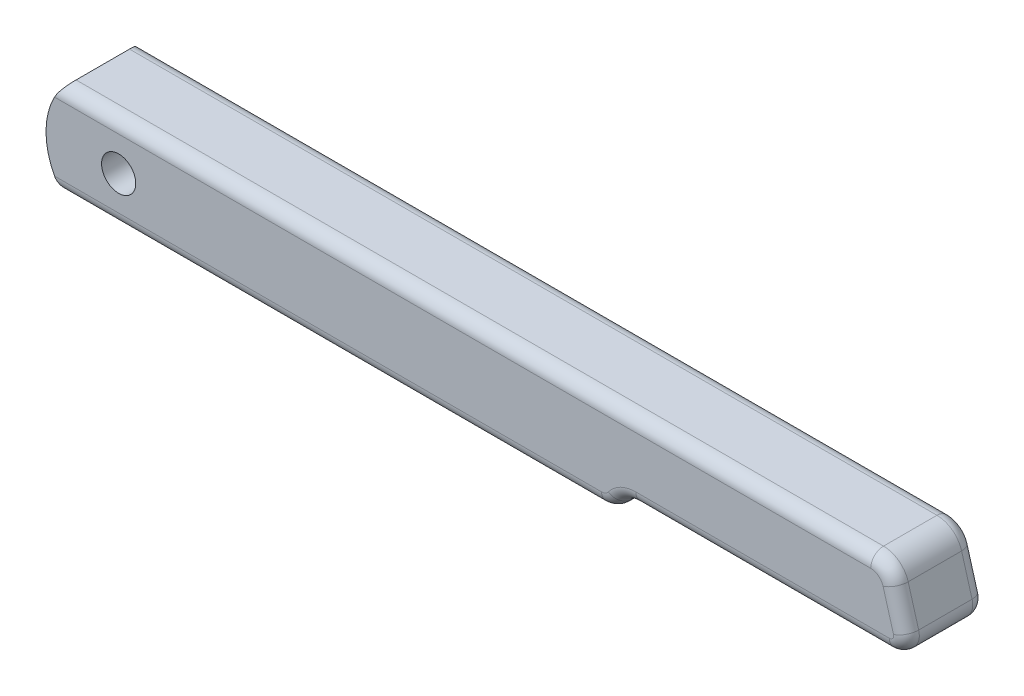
ISO-10303-21;
HEADER;
FILE_DESCRIPTION(('STEP AP214'),'2;1');
FILE_NAME('part.step','',(''),(''),'','','');
FILE_SCHEMA(('AUTOMOTIVE_DESIGN { 1 0 10303 214 1 1 1 1 }'));
ENDSEC;
DATA;
#1=APPLICATION_CONTEXT('core data for automotive mechanical design processes');
#2=APPLICATION_PROTOCOL_DEFINITION('international standard','automotive_design',2000,#1);
#3=PRODUCT_CONTEXT('',#1,'mechanical');
#4=PRODUCT('Part','Part','',(#3));
#5=PRODUCT_RELATED_PRODUCT_CATEGORY('part','',(#4));
#6=PRODUCT_DEFINITION_FORMATION('','',#4);
#7=PRODUCT_DEFINITION_CONTEXT('part definition',#1,'design');
#8=PRODUCT_DEFINITION('design','',#6,#7);
#9=PRODUCT_DEFINITION_SHAPE('','',#8);
#10=(LENGTH_UNIT() NAMED_UNIT(*) SI_UNIT(.MILLI.,.METRE.));
#11=(NAMED_UNIT(*) PLANE_ANGLE_UNIT() SI_UNIT($,.RADIAN.));
#12=(NAMED_UNIT(*) SI_UNIT($,.STERADIAN.) SOLID_ANGLE_UNIT());
#13=UNCERTAINTY_MEASURE_WITH_UNIT(LENGTH_MEASURE(1.E-05),#10,'distance_accuracy_value','');
#14=(GEOMETRIC_REPRESENTATION_CONTEXT(3) GLOBAL_UNCERTAINTY_ASSIGNED_CONTEXT((#13)) GLOBAL_UNIT_ASSIGNED_CONTEXT((#10,
#11,#12)) REPRESENTATION_CONTEXT('',''));
#15=CARTESIAN_POINT('',(0.,0.,0.));
#16=DIRECTION('',(0.,0.,1.));
#17=DIRECTION('',(1.,0.,0.));
#18=AXIS2_PLACEMENT_3D('',#15,#16,#17);
#19=CARTESIAN_POINT('',(0.,0.,18.5));
#20=DIRECTION('',(0.,0.,1.));
#21=DIRECTION('',(1.,0.,0.));
#22=AXIS2_PLACEMENT_3D('',#19,#20,#21);
#23=PLANE('',#22);
#24=CARTESIAN_POINT('',(175.978675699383,5.,18.5));
#25=DIRECTION('',(0.,0.,1.));
#26=DIRECTION('',(1.,0.,0.));
#27=AXIS2_PLACEMENT_3D('',#24,#25,#26);
#28=CIRCLE('',#27,3.);
#29=CARTESIAN_POINT('',(178.862460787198,5.82691206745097,18.5));
#30=VERTEX_POINT('',#29);
#31=CARTESIAN_POINT('',(175.978675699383,8.,18.5));
#32=VERTEX_POINT('',#31);
#33=EDGE_CURVE('E608',#30,#32,#28,.T.);
#34=ORIENTED_EDGE('',*,*,#33,.T.);
#35=DIRECTION('',(-1.,0.,0.));
#36=VECTOR('',#35,1.);
#37=CARTESIAN_POINT('',(-12.9614813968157,8.,18.5));
#38=LINE('',#37,#36);
#39=CARTESIAN_POINT('',(-15.,8.,18.5));
#40=VERTEX_POINT('',#39);
#41=EDGE_CURVE('E610',#32,#40,#38,.T.);
#42=ORIENTED_EDGE('',*,*,#41,.T.);
#43=CARTESIAN_POINT('',(0.,0.,18.5));
#44=DIRECTION('',(0.,0.,1.));
#45=DIRECTION('',(1.,0.,0.));
#46=AXIS2_PLACEMENT_3D('',#43,#44,#45);
#47=CIRCLE('',#46,17.);
#48=CARTESIAN_POINT('',(-15.,-8.,18.5));
#49=VERTEX_POINT('',#48);
#50=EDGE_CURVE('E560',#40,#49,#47,.T.);
#51=ORIENTED_EDGE('',*,*,#50,.T.);
#52=DIRECTION('',(1.,0.,0.));
#53=VECTOR('',#52,1.);
#54=CARTESIAN_POINT('',(113.,-8.,18.5));
#55=LINE('',#54,#53);
#56=CARTESIAN_POINT('',(113.,-8.,18.5));
#57=VERTEX_POINT('',#56);
#58=EDGE_CURVE('E597',#49,#57,#55,.T.);
#59=ORIENTED_EDGE('',*,*,#58,.T.);
#60=CARTESIAN_POINT('',(113.,-6.,18.5));
#61=DIRECTION('',(0.,0.,1.));
#62=DIRECTION('',(1.,0.,0.));
#63=AXIS2_PLACEMENT_3D('',#60,#61,#62);
#64=CIRCLE('',#63,2.);
#65=CARTESIAN_POINT('',(114.6,-7.2,18.5));
#66=VERTEX_POINT('',#65);
#67=EDGE_CURVE('E599',#57,#66,#64,.T.);
#68=ORIENTED_EDGE('',*,*,#67,.T.);
#69=CARTESIAN_POINT('',(121.,-12.,18.5));
#70=DIRECTION('',(0.,0.,1.));
#71=DIRECTION('',(1.,0.,0.));
#72=AXIS2_PLACEMENT_3D('',#69,#70,#71);
#73=CIRCLE('',#72,8.);
#74=CARTESIAN_POINT('',(121.,-4.,18.5));
#75=VERTEX_POINT('',#74);
#76=EDGE_CURVE('E601',#66,#75,#73,.F.);
#77=ORIENTED_EDGE('',*,*,#76,.T.);
#78=DIRECTION('',(1.,0.,0.));
#79=VECTOR('',#78,1.);
#80=CARTESIAN_POINT('',(180.353237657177,-4.,18.5));
#81=LINE('',#80,#79);
#82=CARTESIAN_POINT('',(180.353237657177,-4.,18.5));
#83=VERTEX_POINT('',#82);
#84=EDGE_CURVE('E603',#75,#83,#81,.T.);
#85=ORIENTED_EDGE('',*,*,#84,.T.);
#86=CARTESIAN_POINT('',(180.353237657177,-3.,18.5));
#87=DIRECTION('',(0.,0.,1.));
#88=DIRECTION('',(1.,0.,0.));
#89=AXIS2_PLACEMENT_3D('',#86,#87,#88);
#90=CIRCLE('',#89,0.99999999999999);
#91=CARTESIAN_POINT('',(181.314499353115,-2.72436264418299,18.5));
#92=VERTEX_POINT('',#91);
#93=EDGE_CURVE('E513',#83,#92,#90,.T.);
#94=ORIENTED_EDGE('',*,*,#93,.T.);
#95=DIRECTION('',(-0.275637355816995,0.96126169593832,0.));
#96=VECTOR('',#95,1.);
#97=CARTESIAN_POINT('',(178.862460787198,5.82691206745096,18.5));
#98=LINE('',#97,#96);
#99=EDGE_CURVE('E606',#92,#30,#98,.T.);
#100=ORIENTED_EDGE('',*,*,#99,.T.);
#101=EDGE_LOOP('',(#34,#42,#51,#59,#68,#77,#85,#94,#100));
#102=FACE_BOUND('',#101,.T.);
#103=CARTESIAN_POINT('',(0.,0.,18.5));
#104=DIRECTION('',(0.,0.,1.));
#105=DIRECTION('',(1.,0.,0.));
#106=AXIS2_PLACEMENT_3D('',#103,#104,#105);
#107=CIRCLE('',#106,4.);
#108=CARTESIAN_POINT('',(4.,0.,18.5));
#109=VERTEX_POINT('',#108);
#110=EDGE_CURVE('E554',#109,#109,#107,.T.);
#111=ORIENTED_EDGE('',*,*,#110,.F.);
#112=EDGE_LOOP('',(#111));
#113=FACE_BOUND('',#112,.T.);
#114=ADVANCED_FACE('F350',(#102,#113),#23,.T.);
#115=CARTESIAN_POINT('',(0.,0.,0.));
#116=DIRECTION('',(0.,0.,1.));
#117=DIRECTION('',(1.,0.,0.));
#118=AXIS2_PLACEMENT_3D('',#115,#116,#117);
#119=PLANE('',#118);
#120=CARTESIAN_POINT('',(113.,-6.,0.));
#121=DIRECTION('',(0.,0.,1.));
#122=DIRECTION('',(1.,0.,0.));
#123=AXIS2_PLACEMENT_3D('',#120,#121,#122);
#124=CIRCLE('',#123,2.);
#125=CARTESIAN_POINT('',(114.6,-7.19999999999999,0.));
#126=VERTEX_POINT('',#125);
#127=CARTESIAN_POINT('',(113.,-8.,0.));
#128=VERTEX_POINT('',#127);
#129=EDGE_CURVE('E593',#126,#128,#124,.F.);
#130=ORIENTED_EDGE('',*,*,#129,.T.);
#131=DIRECTION('',(1.,0.,0.));
#132=VECTOR('',#131,1.);
#133=CARTESIAN_POINT('',(0.,-8.,0.));
#134=LINE('',#133,#132);
#135=CARTESIAN_POINT('',(-15.,-8.,0.));
#136=VERTEX_POINT('',#135);
#137=EDGE_CURVE('E487',#128,#136,#134,.F.);
#138=ORIENTED_EDGE('',*,*,#137,.T.);
#139=CARTESIAN_POINT('',(0.,0.,0.));
#140=DIRECTION('',(0.,0.,1.));
#141=DIRECTION('',(1.,0.,0.));
#142=AXIS2_PLACEMENT_3D('',#139,#140,#141);
#143=CIRCLE('',#142,17.);
#144=CARTESIAN_POINT('',(-15.,8.,0.));
#145=VERTEX_POINT('',#144);
#146=EDGE_CURVE('E557',#145,#136,#143,.T.);
#147=ORIENTED_EDGE('',*,*,#146,.F.);
#148=DIRECTION('',(-1.,0.,0.));
#149=VECTOR('',#148,1.);
#150=CARTESIAN_POINT('',(0.,8.,0.));
#151=LINE('',#150,#149);
#152=CARTESIAN_POINT('',(175.978675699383,8.,0.));
#153=VERTEX_POINT('',#152);
#154=EDGE_CURVE('E581',#145,#153,#151,.F.);
#155=ORIENTED_EDGE('',*,*,#154,.T.);
#156=CARTESIAN_POINT('',(175.978675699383,5.,0.));
#157=DIRECTION('',(0.,0.,1.));
#158=DIRECTION('',(1.,0.,0.));
#159=AXIS2_PLACEMENT_3D('',#156,#157,#158);
#160=CIRCLE('',#159,3.);
#161=CARTESIAN_POINT('',(178.862460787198,5.82691206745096,0.));
#162=VERTEX_POINT('',#161);
#163=EDGE_CURVE('E583',#153,#162,#160,.F.);
#164=ORIENTED_EDGE('',*,*,#163,.T.);
#165=DIRECTION('',(-0.275637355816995,0.96126169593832,0.));
#166=VECTOR('',#165,1.);
#167=CARTESIAN_POINT('',(166.817111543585,47.8340370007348,0.));
#168=LINE('',#167,#166);
#169=CARTESIAN_POINT('',(181.314499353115,-2.72436264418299,0.));
#170=VERTEX_POINT('',#169);
#171=EDGE_CURVE('E585',#162,#170,#168,.F.);
#172=ORIENTED_EDGE('',*,*,#171,.T.);
#173=CARTESIAN_POINT('',(180.353237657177,-3.,0.));
#174=DIRECTION('',(0.,0.,1.));
#175=DIRECTION('',(1.,0.,0.));
#176=AXIS2_PLACEMENT_3D('',#173,#174,#175);
#177=CIRCLE('',#176,0.99999999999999);
#178=CARTESIAN_POINT('',(180.353237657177,-3.99999999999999,0.));
#179=VERTEX_POINT('',#178);
#180=EDGE_CURVE('E587',#170,#179,#177,.F.);
#181=ORIENTED_EDGE('',*,*,#180,.T.);
#182=DIRECTION('',(1.,0.,0.));
#183=VECTOR('',#182,1.);
#184=CARTESIAN_POINT('',(0.,-4.,0.));
#185=LINE('',#184,#183);
#186=CARTESIAN_POINT('',(121.,-4.,0.));
#187=VERTEX_POINT('',#186);
#188=EDGE_CURVE('E589',#179,#187,#185,.F.);
#189=ORIENTED_EDGE('',*,*,#188,.T.);
#190=CARTESIAN_POINT('',(121.,-12.,0.));
#191=DIRECTION('',(0.,0.,1.));
#192=DIRECTION('',(1.,0.,0.));
#193=AXIS2_PLACEMENT_3D('',#190,#191,#192);
#194=CIRCLE('',#193,8.);
#195=EDGE_CURVE('E591',#187,#126,#194,.T.);
#196=ORIENTED_EDGE('',*,*,#195,.T.);
#197=EDGE_LOOP('',(#130,#138,#147,#155,#164,#172,#181,#189,#196));
#198=FACE_BOUND('',#197,.T.);
#199=CARTESIAN_POINT('',(0.,0.,0.));
#200=DIRECTION('',(0.,0.,1.));
#201=DIRECTION('',(1.,0.,0.));
#202=AXIS2_PLACEMENT_3D('',#199,#200,#201);
#203=CIRCLE('',#202,4.);
#204=CARTESIAN_POINT('',(4.,0.,0.));
#205=VERTEX_POINT('',#204);
#206=EDGE_CURVE('E551',#205,#205,#203,.T.);
#207=ORIENTED_EDGE('',*,*,#206,.T.);
#208=EDGE_LOOP('',(#207));
#209=FACE_BOUND('',#208,.T.);
#210=ADVANCED_FACE('F721',(#198,#209),#119,.F.);
#211=CARTESIAN_POINT('',(0.,0.,18.5));
#212=DIRECTION('',(0.,0.,-1.));
#213=DIRECTION('',(-1.,0.,0.));
#214=AXIS2_PLACEMENT_3D('',#211,#212,#213);
#215=CYLINDRICAL_SURFACE('',#214,17.);
#216=ORIENTED_EDGE('',*,*,#146,.T.);
#217=CARTESIAN_POINT('',(-15.,-8.,0.));
#218=CARTESIAN_POINT('',(-14.939659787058,-8.11317613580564,2.71982184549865E-06));
#219=CARTESIAN_POINT('',(-14.8780291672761,-8.22561204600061,0.00640320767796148));
#220=CARTESIAN_POINT('',(-14.7528823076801,-8.44799240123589,0.0315286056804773));
#221=CARTESIAN_POINT('',(-14.6893666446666,-8.55793759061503,0.050249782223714));
#222=CARTESIAN_POINT('',(-14.5610229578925,-8.77453794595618,0.0995785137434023));
#223=CARTESIAN_POINT('',(-14.4961933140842,-8.88118858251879,0.130201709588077));
#224=CARTESIAN_POINT('',(-14.3660712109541,-9.0901688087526,0.202898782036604));
#225=CARTESIAN_POINT('',(-14.3007787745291,-9.19249861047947,0.244972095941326));
#226=CARTESIAN_POINT('',(-14.1229513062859,-9.46491234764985,0.375002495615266));
#227=CARTESIAN_POINT('',(-14.0106672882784,-9.63002074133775,0.474052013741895));
#228=CARTESIAN_POINT('',(-13.7920585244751,-9.94058061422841,0.704039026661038));
#229=CARTESIAN_POINT('',(-13.6857261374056,-10.0860576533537,0.834934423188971));
#230=CARTESIAN_POINT('',(-13.5079501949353,-10.3224044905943,1.09475366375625));
#231=CARTESIAN_POINT('',(-13.4340366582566,-10.4181987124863,1.21750803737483));
#232=CARTESIAN_POINT('',(-13.2976435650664,-10.5917339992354,1.48089016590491));
#233=CARTESIAN_POINT('',(-13.2351492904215,-10.6694983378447,1.62149451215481));
#234=CARTESIAN_POINT('',(-13.1361692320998,-10.7910185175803,1.89181944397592));
#235=CARTESIAN_POINT('',(-13.0970266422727,-10.8383764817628,2.01894248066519));
#236=CARTESIAN_POINT('',(-13.0324869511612,-10.9158994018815,2.28155481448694));
#237=CARTESIAN_POINT('',(-13.0070607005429,-10.9461008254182,2.41702568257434));
#238=CARTESIAN_POINT('',(-12.9803107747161,-10.9777834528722,2.6280871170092));
#239=CARTESIAN_POINT('',(-12.97327596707,-10.9860910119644,2.70201079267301));
#240=CARTESIAN_POINT('',(-12.9638524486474,-10.997206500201,2.85060693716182));
#241=CARTESIAN_POINT('',(-12.9614665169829,-11.0000111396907,2.92527982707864));
#242=CARTESIAN_POINT('',(-12.9614813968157,-11.,3.));
#243=B_SPLINE_CURVE_WITH_KNOTS('',3,(#217,#218,#219,#220,#221,#222,#223,#224,#225,#226,#227,
#228,#229,#230,#231,#232,#233,#234,#235,#236,#237,#238,#239,#240,#241,#242),.UNSPECIFIED.,.F.,
.F.,(4,2,2,2,2,2,2,2,2,2,2,2,4),(0.,0.384534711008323,0.768952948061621,1.1538780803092,
1.5387842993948,2.20422122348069,2.86878321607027,3.38397654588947,3.89850109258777,
4.32039769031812,4.74139412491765,4.96524162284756,5.18922289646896),.UNSPECIFIED.);
#244=CARTESIAN_POINT('',(-12.9614813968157,-11.,3.));
#245=VERTEX_POINT('',#244);
#246=EDGE_CURVE('E683',#136,#245,#243,.T.);
#247=ORIENTED_EDGE('',*,*,#246,.T.);
#248=DIRECTION('',(0.,0.,-1.));
#249=VECTOR('',#248,1.);
#250=CARTESIAN_POINT('',(-12.9614813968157,-11.,18.5));
#251=LINE('',#250,#249);
#252=CARTESIAN_POINT('',(-12.9614813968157,-11.,15.5));
#253=VERTEX_POINT('',#252);
#254=EDGE_CURVE('E509',#253,#245,#251,.T.);
#255=ORIENTED_EDGE('',*,*,#254,.F.);
#256=CARTESIAN_POINT('',(-12.9614813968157,-11.,15.5));
#257=CARTESIAN_POINT('',(-12.9614620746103,-11.0000165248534,15.5715650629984));
#258=CARTESIAN_POINT('',(-12.9636540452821,-10.9974398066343,15.6431164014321));
#259=CARTESIAN_POINT('',(-12.9723127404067,-10.9872281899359,15.7855431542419));
#260=CARTESIAN_POINT('',(-12.9787761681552,-10.9795971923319,15.8564190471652));
#261=CARTESIAN_POINT('',(-12.9957610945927,-10.959486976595,15.9963877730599));
#262=CARTESIAN_POINT('',(-13.006249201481,-10.9470476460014,16.0654904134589));
#263=CARTESIAN_POINT('',(-13.0310216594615,-10.9175476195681,16.2019962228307));
#264=CARTESIAN_POINT('',(-13.0453065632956,-10.9004862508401,16.2693991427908));
#265=CARTESIAN_POINT('',(-13.0933103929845,-10.8428651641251,16.4680066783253));
#266=CARTESIAN_POINT('',(-13.1322463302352,-10.7957895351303,16.596140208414));
#267=CARTESIAN_POINT('',(-13.2212661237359,-10.6865842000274,16.841805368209));
#268=CARTESIAN_POINT('',(-13.271376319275,-10.6244188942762,16.9593110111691));
#269=CARTESIAN_POINT('',(-13.399501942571,-10.4626671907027,17.2224735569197));
#270=CARTESIAN_POINT('',(-13.4810752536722,-10.3576601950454,17.363079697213));
#271=CARTESIAN_POINT('',(-13.6539194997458,-10.1287269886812,17.6209296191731));
#272=CARTESIAN_POINT('',(-13.745202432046,-10.0047772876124,17.7381439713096));
#273=CARTESIAN_POINT('',(-13.9342909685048,-9.73973206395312,17.9499957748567));
#274=CARTESIAN_POINT('',(-14.0321682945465,-9.59842663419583,18.0443051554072));
#275=CARTESIAN_POINT('',(-14.229641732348,-9.30316308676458,18.2074352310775));
#276=CARTESIAN_POINT('',(-14.3292364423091,-9.14921493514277,18.2762757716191));
#277=CARTESIAN_POINT('',(-14.5262700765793,-8.83299152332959,18.3868383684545));
#278=CARTESIAN_POINT('',(-14.6237206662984,-8.67082515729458,18.4288474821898));
#279=CARTESIAN_POINT('',(-14.767188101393,-8.42255043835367,18.4712827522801));
#280=CARTESIAN_POINT('',(-14.8145916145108,-8.33889395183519,18.4819983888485));
#281=CARTESIAN_POINT('',(-14.9082348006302,-8.17030317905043,18.4963557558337));
#282=CARTESIAN_POINT('',(-14.9544741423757,-8.08536853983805,18.4999954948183));
#283=CARTESIAN_POINT('',(-15.,-8.,18.5));
#284=B_SPLINE_CURVE_WITH_KNOTS('',3,(#256,#257,#258,#259,#260,#261,#262,#263,#264,#265,#266,
#267,#268,#269,#270,#271,#272,#273,#274,#275,#276,#277,#278,#279,#280,#281,#282,#283),
.UNSPECIFIED.,.F.,.F.,(4,2,2,2,2,2,2,2,2,2,2,2,2,4),(0.,0.214592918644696,0.429020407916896,
0.641706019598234,0.854422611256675,1.27825616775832,1.70309952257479,2.28055847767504,
2.85873942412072,3.44476893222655,4.03034083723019,4.60953812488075,4.89954572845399,
5.18963493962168),.UNSPECIFIED.);
#285=EDGE_CURVE('E632',#253,#49,#284,.T.);
#286=ORIENTED_EDGE('',*,*,#285,.T.);
#287=ORIENTED_EDGE('',*,*,#50,.F.);
#288=CARTESIAN_POINT('',(-15.,8.,18.5));
#289=CARTESIAN_POINT('',(-14.939659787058,8.11317613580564,18.4999972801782));
#290=CARTESIAN_POINT('',(-14.8780291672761,8.22561204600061,18.493596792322));
#291=CARTESIAN_POINT('',(-14.7528823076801,8.44799240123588,18.4684713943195));
#292=CARTESIAN_POINT('',(-14.6893666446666,8.55793759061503,18.4497502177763));
#293=CARTESIAN_POINT('',(-14.5610229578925,8.77453794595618,18.4004214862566));
#294=CARTESIAN_POINT('',(-14.4961933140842,8.88118858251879,18.3697982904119));
#295=CARTESIAN_POINT('',(-14.3660712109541,9.0901688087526,18.2971012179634));
#296=CARTESIAN_POINT('',(-14.3007787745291,9.19249861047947,18.2550279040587));
#297=CARTESIAN_POINT('',(-14.1229513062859,9.46491234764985,18.1249975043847));
#298=CARTESIAN_POINT('',(-14.0106672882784,9.63002074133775,18.0259479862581));
#299=CARTESIAN_POINT('',(-13.7920585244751,9.94058061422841,17.795960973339));
#300=CARTESIAN_POINT('',(-13.6857261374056,10.0860576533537,17.665065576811));
#301=CARTESIAN_POINT('',(-13.5079501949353,10.3224044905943,17.4052463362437));
#302=CARTESIAN_POINT('',(-13.4340366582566,10.4181987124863,17.2824919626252));
#303=CARTESIAN_POINT('',(-13.2976435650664,10.5917339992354,17.0191098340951));
#304=CARTESIAN_POINT('',(-13.2351492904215,10.6694983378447,16.8785054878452));
#305=CARTESIAN_POINT('',(-13.1361692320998,10.7910185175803,16.6081805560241));
#306=CARTESIAN_POINT('',(-13.0970266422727,10.8383764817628,16.4810575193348));
#307=CARTESIAN_POINT('',(-13.0324869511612,10.9158994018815,16.2184451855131));
#308=CARTESIAN_POINT('',(-13.0070607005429,10.9461008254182,16.0829743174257));
#309=CARTESIAN_POINT('',(-12.9803107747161,10.9777834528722,15.8719128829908));
#310=CARTESIAN_POINT('',(-12.97327596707,10.9860910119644,15.797989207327));
#311=CARTESIAN_POINT('',(-12.9638524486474,10.997206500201,15.6493930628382));
#312=CARTESIAN_POINT('',(-12.9614665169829,11.0000111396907,15.5747201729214));
#313=CARTESIAN_POINT('',(-12.9614813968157,11.,15.5));
#314=B_SPLINE_CURVE_WITH_KNOTS('',3,(#288,#289,#290,#291,#292,#293,#294,#295,#296,#297,#298,
#299,#300,#301,#302,#303,#304,#305,#306,#307,#308,#309,#310,#311,#312,#313),.UNSPECIFIED.,.F.,
.F.,(4,2,2,2,2,2,2,2,2,2,2,2,4),(0.,0.384534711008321,0.768952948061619,1.1538780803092,
1.5387842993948,2.20422122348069,2.86878321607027,3.38397654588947,3.89850109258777,
4.32039769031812,4.74139412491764,4.96524162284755,5.18922289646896),.UNSPECIFIED.);
#315=CARTESIAN_POINT('',(-12.9614813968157,11.,15.5));
#316=VERTEX_POINT('',#315);
#317=EDGE_CURVE('E371',#40,#316,#314,.T.);
#318=ORIENTED_EDGE('',*,*,#317,.T.);
#319=DIRECTION('',(0.,0.,-1.));
#320=VECTOR('',#319,1.);
#321=CARTESIAN_POINT('',(-12.9614813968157,11.,18.5));
#322=LINE('',#321,#320);
#323=CARTESIAN_POINT('',(-12.9614813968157,11.,3.));
#324=VERTEX_POINT('',#323);
#325=EDGE_CURVE('E563',#316,#324,#322,.T.);
#326=ORIENTED_EDGE('',*,*,#325,.T.);
#327=CARTESIAN_POINT('',(-12.9614813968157,11.,3.));
#328=CARTESIAN_POINT('',(-12.9614620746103,11.0000165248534,2.92843493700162));
#329=CARTESIAN_POINT('',(-12.9636540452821,10.9974398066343,2.85688359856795));
#330=CARTESIAN_POINT('',(-12.9723127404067,10.9872281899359,2.71445684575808));
#331=CARTESIAN_POINT('',(-12.9787761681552,10.9795971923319,2.64358095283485));
#332=CARTESIAN_POINT('',(-12.9957610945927,10.959486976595,2.50361222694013));
#333=CARTESIAN_POINT('',(-13.006249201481,10.9470476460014,2.43450958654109));
#334=CARTESIAN_POINT('',(-13.0310216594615,10.9175476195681,2.29800377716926));
#335=CARTESIAN_POINT('',(-13.0453065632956,10.9004862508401,2.23060085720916));
#336=CARTESIAN_POINT('',(-13.0933103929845,10.8428651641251,2.03199332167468));
#337=CARTESIAN_POINT('',(-13.1322463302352,10.7957895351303,1.90385979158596));
#338=CARTESIAN_POINT('',(-13.2212661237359,10.6865842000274,1.65819463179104));
#339=CARTESIAN_POINT('',(-13.271376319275,10.6244188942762,1.54068898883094));
#340=CARTESIAN_POINT('',(-13.399501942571,10.4626671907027,1.27752644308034));
#341=CARTESIAN_POINT('',(-13.4810752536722,10.3576601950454,1.13692030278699));
#342=CARTESIAN_POINT('',(-13.6539194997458,10.1287269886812,0.879070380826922));
#343=CARTESIAN_POINT('',(-13.745202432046,10.0047772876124,0.761856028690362));
#344=CARTESIAN_POINT('',(-13.9342909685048,9.73973206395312,0.550004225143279));
#345=CARTESIAN_POINT('',(-14.0321682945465,9.59842663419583,0.455694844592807));
#346=CARTESIAN_POINT('',(-14.229641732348,9.30316308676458,0.292564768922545));
#347=CARTESIAN_POINT('',(-14.3292364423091,9.14921493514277,0.223724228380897));
#348=CARTESIAN_POINT('',(-14.5262700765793,8.83299152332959,0.113161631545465));
#349=CARTESIAN_POINT('',(-14.6237206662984,8.67082515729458,0.0711525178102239));
#350=CARTESIAN_POINT('',(-14.767188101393,8.42255043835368,0.0287172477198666));
#351=CARTESIAN_POINT('',(-14.8145916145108,8.33889395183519,0.0180016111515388));
#352=CARTESIAN_POINT('',(-14.9082348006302,8.17030317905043,0.00364424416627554));
#353=CARTESIAN_POINT('',(-14.9544741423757,8.08536853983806,4.5051817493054E-06));
#354=CARTESIAN_POINT('',(-15.,8.,0.));
#355=B_SPLINE_CURVE_WITH_KNOTS('',3,(#327,#328,#329,#330,#331,#332,#333,#334,#335,#336,#337,
#338,#339,#340,#341,#342,#343,#344,#345,#346,#347,#348,#349,#350,#351,#352,#353,#354),
.UNSPECIFIED.,.F.,.F.,(4,2,2,2,2,2,2,2,2,2,2,2,2,4),(0.,0.214592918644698,0.429020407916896,
0.641706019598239,0.854422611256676,1.27825616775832,1.70309952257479,2.28055847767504,
2.85873942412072,3.44476893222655,4.03034083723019,4.60953812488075,4.89954572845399,
5.18963493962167),.UNSPECIFIED.);
#356=EDGE_CURVE('E687',#324,#145,#355,.T.);
#357=ORIENTED_EDGE('',*,*,#356,.T.);
#358=EDGE_LOOP('',(#216,#247,#255,#286,#287,#318,#326,#357));
#359=FACE_BOUND('',#358,.T.);
#360=ADVANCED_FACE('F352',(#359),#215,.T.);
#361=CARTESIAN_POINT('',(-12.9614813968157,-11.,18.5));
#362=DIRECTION('',(0.,1.,0.));
#363=DIRECTION('',(0.,0.,1.));
#364=AXIS2_PLACEMENT_3D('',#361,#362,#363);
#365=PLANE('',#364);
#366=ORIENTED_EDGE('',*,*,#254,.T.);
#367=DIRECTION('',(1.,0.,0.));
#368=VECTOR('',#367,1.);
#369=CARTESIAN_POINT('',(-12.9614813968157,-11.,3.));
#370=LINE('',#369,#368);
#371=CARTESIAN_POINT('',(113.,-11.,3.));
#372=VERTEX_POINT('',#371);
#373=EDGE_CURVE('E630',#245,#372,#370,.T.);
#374=ORIENTED_EDGE('',*,*,#373,.T.);
#375=DIRECTION('',(0.,0.,-1.));
#376=VECTOR('',#375,1.);
#377=CARTESIAN_POINT('',(113.,-11.,18.5));
#378=LINE('',#377,#376);
#379=CARTESIAN_POINT('',(113.,-11.,15.5));
#380=VERTEX_POINT('',#379);
#381=EDGE_CURVE('E575',#380,#372,#378,.T.);
#382=ORIENTED_EDGE('',*,*,#381,.F.);
#383=DIRECTION('',(1.,0.,0.));
#384=VECTOR('',#383,1.);
#385=CARTESIAN_POINT('',(-12.9614813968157,-11.,15.5));
#386=LINE('',#385,#384);
#387=EDGE_CURVE('E628',#380,#253,#386,.F.);
#388=ORIENTED_EDGE('',*,*,#387,.T.);
#389=EDGE_LOOP('',(#366,#374,#382,#388));
#390=FACE_BOUND('',#389,.T.);
#391=ADVANCED_FACE('F736',(#390),#365,.F.);
#392=CARTESIAN_POINT('',(113.,-6.,18.5));
#393=DIRECTION('',(0.,0.,-1.));
#394=DIRECTION('',(-1.,0.,0.));
#395=AXIS2_PLACEMENT_3D('',#392,#393,#394);
#396=CYLINDRICAL_SURFACE('',#395,5.);
#397=ORIENTED_EDGE('',*,*,#381,.T.);
#398=CARTESIAN_POINT('',(113.,-6.,3.));
#399=DIRECTION('',(0.,0.,1.));
#400=DIRECTION('',(1.,0.,0.));
#401=AXIS2_PLACEMENT_3D('',#398,#399,#400);
#402=CIRCLE('',#401,5.);
#403=CARTESIAN_POINT('',(117.,-9.,3.));
#404=VERTEX_POINT('',#403);
#405=EDGE_CURVE('E622',#372,#404,#402,.T.);
#406=ORIENTED_EDGE('',*,*,#405,.T.);
#407=DIRECTION('',(0.,0.,-1.));
#408=VECTOR('',#407,1.);
#409=CARTESIAN_POINT('',(117.,-9.,18.5));
#410=LINE('',#409,#408);
#411=CARTESIAN_POINT('',(117.,-9.,15.5));
#412=VERTEX_POINT('',#411);
#413=EDGE_CURVE('E572',#412,#404,#410,.T.);
#414=ORIENTED_EDGE('',*,*,#413,.F.);
#415=CARTESIAN_POINT('',(113.,-6.,15.5));
#416=DIRECTION('',(0.,0.,1.));
#417=DIRECTION('',(1.,0.,0.));
#418=AXIS2_PLACEMENT_3D('',#415,#416,#417);
#419=CIRCLE('',#418,5.);
#420=EDGE_CURVE('E620',#412,#380,#419,.F.);
#421=ORIENTED_EDGE('',*,*,#420,.T.);
#422=EDGE_LOOP('',(#397,#406,#414,#421));
#423=FACE_BOUND('',#422,.T.);
#424=ADVANCED_FACE('F739',(#423),#396,.T.);
#425=CARTESIAN_POINT('',(121.,-12.,18.5));
#426=DIRECTION('',(0.,0.,-1.));
#427=DIRECTION('',(-1.,0.,0.));
#428=AXIS2_PLACEMENT_3D('',#425,#426,#427);
#429=CYLINDRICAL_SURFACE('',#428,5.);
#430=ORIENTED_EDGE('',*,*,#413,.T.);
#431=CARTESIAN_POINT('',(121.,-12.,3.));
#432=DIRECTION('',(0.,0.,1.));
#433=DIRECTION('',(1.,0.,0.));
#434=AXIS2_PLACEMENT_3D('',#431,#432,#433);
#435=CIRCLE('',#434,5.);
#436=CARTESIAN_POINT('',(121.,-7.,3.));
#437=VERTEX_POINT('',#436);
#438=EDGE_CURVE('E614',#404,#437,#435,.F.);
#439=ORIENTED_EDGE('',*,*,#438,.T.);
#440=DIRECTION('',(0.,0.,-1.));
#441=VECTOR('',#440,1.);
#442=CARTESIAN_POINT('',(121.,-7.,18.5));
#443=LINE('',#442,#441);
#444=CARTESIAN_POINT('',(121.,-7.,15.5));
#445=VERTEX_POINT('',#444);
#446=EDGE_CURVE('E498',#445,#437,#443,.T.);
#447=ORIENTED_EDGE('',*,*,#446,.F.);
#448=CARTESIAN_POINT('',(121.,-12.,15.5));
#449=DIRECTION('',(0.,0.,1.));
#450=DIRECTION('',(1.,0.,0.));
#451=AXIS2_PLACEMENT_3D('',#448,#449,#450);
#452=CIRCLE('',#451,5.);
#453=EDGE_CURVE('E612',#445,#412,#452,.T.);
#454=ORIENTED_EDGE('',*,*,#453,.T.);
#455=EDGE_LOOP('',(#430,#439,#447,#454));
#456=FACE_BOUND('',#455,.T.);
#457=ADVANCED_FACE('F778',(#456),#429,.F.);
#458=CARTESIAN_POINT('',(121.,-7.,18.5));
#459=DIRECTION('',(0.,1.,0.));
#460=DIRECTION('',(0.,0.,1.));
#461=AXIS2_PLACEMENT_3D('',#458,#459,#460);
#462=PLANE('',#461);
#463=ORIENTED_EDGE('',*,*,#446,.T.);
#464=DIRECTION('',(1.,0.,0.));
#465=VECTOR('',#464,1.);
#466=CARTESIAN_POINT('',(121.,-7.,3.));
#467=LINE('',#466,#465);
#468=CARTESIAN_POINT('',(180.353237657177,-6.99999999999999,3.));
#469=VERTEX_POINT('',#468);
#470=EDGE_CURVE('E497',#437,#469,#467,.T.);
#471=ORIENTED_EDGE('',*,*,#470,.T.);
#472=DIRECTION('',(0.,0.,-1.));
#473=VECTOR('',#472,1.);
#474=CARTESIAN_POINT('',(180.353237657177,-6.99999999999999,18.5));
#475=LINE('',#474,#473);
#476=CARTESIAN_POINT('',(180.353237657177,-6.99999999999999,15.5));
#477=VERTEX_POINT('',#476);
#478=EDGE_CURVE('E480',#477,#469,#475,.T.);
#479=ORIENTED_EDGE('',*,*,#478,.F.);
#480=DIRECTION('',(1.,0.,0.));
#481=VECTOR('',#480,1.);
#482=CARTESIAN_POINT('',(121.,-7.,15.5));
#483=LINE('',#482,#481);
#484=EDGE_CURVE('E494',#477,#445,#483,.F.);
#485=ORIENTED_EDGE('',*,*,#484,.T.);
#486=EDGE_LOOP('',(#463,#471,#479,#485));
#487=FACE_BOUND('',#486,.T.);
#488=ADVANCED_FACE('F493',(#487),#462,.F.);
#489=CARTESIAN_POINT('',(180.353237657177,-3.,18.5));
#490=DIRECTION('',(0.,0.,-1.));
#491=DIRECTION('',(-1.,0.,0.));
#492=AXIS2_PLACEMENT_3D('',#489,#490,#491);
#493=CYLINDRICAL_SURFACE('',#492,3.99999999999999);
#494=ORIENTED_EDGE('',*,*,#478,.T.);
#495=CARTESIAN_POINT('',(180.353237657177,-3.,3.));
#496=DIRECTION('',(0.,0.,1.));
#497=DIRECTION('',(1.,0.,0.));
#498=AXIS2_PLACEMENT_3D('',#495,#496,#497);
#499=CIRCLE('',#498,3.99999999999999);
#500=CARTESIAN_POINT('',(184.19828444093,-1.89745057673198,3.));
#501=VERTEX_POINT('',#500);
#502=EDGE_CURVE('E486',#469,#501,#499,.T.);
#503=ORIENTED_EDGE('',*,*,#502,.T.);
#504=DIRECTION('',(0.,0.,-1.));
#505=VECTOR('',#504,1.);
#506=CARTESIAN_POINT('',(184.19828444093,-1.89745057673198,18.5));
#507=LINE('',#506,#505);
#508=CARTESIAN_POINT('',(184.19828444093,-1.89745057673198,15.5));
#509=VERTEX_POINT('',#508);
#510=EDGE_CURVE('E482',#509,#501,#507,.T.);
#511=ORIENTED_EDGE('',*,*,#510,.F.);
#512=CARTESIAN_POINT('',(180.353237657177,-3.,15.5));
#513=DIRECTION('',(0.,0.,1.));
#514=DIRECTION('',(1.,0.,0.));
#515=AXIS2_PLACEMENT_3D('',#512,#513,#514);
#516=CIRCLE('',#515,3.99999999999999);
#517=EDGE_CURVE('E477',#509,#477,#516,.F.);
#518=ORIENTED_EDGE('',*,*,#517,.T.);
#519=EDGE_LOOP('',(#494,#503,#511,#518));
#520=FACE_BOUND('',#519,.T.);
#521=ADVANCED_FACE('F479',(#520),#493,.T.);
#522=CARTESIAN_POINT('',(181.746245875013,6.65382413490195,18.5));
#523=DIRECTION('',(-0.96126169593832,-0.275637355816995,0.));
#524=DIRECTION('',(0.275637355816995,-0.96126169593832,0.));
#525=AXIS2_PLACEMENT_3D('',#522,#523,#524);
#526=PLANE('',#525);
#527=ORIENTED_EDGE('',*,*,#510,.T.);
#528=DIRECTION('',(-0.275637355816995,0.96126169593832,0.));
#529=VECTOR('',#528,1.);
#530=CARTESIAN_POINT('',(181.746245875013,6.65382413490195,3.));
#531=LINE('',#530,#529);
#532=CARTESIAN_POINT('',(181.746245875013,6.65382413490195,3.));
#533=VERTEX_POINT('',#532);
#534=EDGE_CURVE('E618',#501,#533,#531,.T.);
#535=ORIENTED_EDGE('',*,*,#534,.T.);
#536=DIRECTION('',(0.,0.,-1.));
#537=VECTOR('',#536,1.);
#538=CARTESIAN_POINT('',(181.746245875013,6.65382413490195,18.5));
#539=LINE('',#538,#537);
#540=CARTESIAN_POINT('',(181.746245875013,6.65382413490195,15.5));
#541=VERTEX_POINT('',#540);
#542=EDGE_CURVE('E567',#541,#533,#539,.T.);
#543=ORIENTED_EDGE('',*,*,#542,.F.);
#544=DIRECTION('',(-0.275637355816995,0.96126169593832,0.));
#545=VECTOR('',#544,1.);
#546=CARTESIAN_POINT('',(184.19828444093,-1.89745057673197,15.5));
#547=LINE('',#546,#545);
#548=EDGE_CURVE('E616',#541,#509,#547,.F.);
#549=ORIENTED_EDGE('',*,*,#548,.T.);
#550=EDGE_LOOP('',(#527,#535,#543,#549));
#551=FACE_BOUND('',#550,.T.);
#552=ADVANCED_FACE('F712',(#551),#526,.F.);
#553=CARTESIAN_POINT('',(175.978675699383,5.,18.5));
#554=DIRECTION('',(0.,0.,-1.));
#555=DIRECTION('',(-1.,0.,0.));
#556=AXIS2_PLACEMENT_3D('',#553,#554,#555);
#557=CYLINDRICAL_SURFACE('',#556,6.);
#558=ORIENTED_EDGE('',*,*,#542,.T.);
#559=CARTESIAN_POINT('',(175.978675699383,5.,3.));
#560=DIRECTION('',(0.,0.,1.));
#561=DIRECTION('',(1.,0.,0.));
#562=AXIS2_PLACEMENT_3D('',#559,#560,#561);
#563=CIRCLE('',#562,6.);
#564=CARTESIAN_POINT('',(175.978675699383,11.,3.));
#565=VERTEX_POINT('',#564);
#566=EDGE_CURVE('E626',#533,#565,#563,.T.);
#567=ORIENTED_EDGE('',*,*,#566,.T.);
#568=DIRECTION('',(0.,0.,-1.));
#569=VECTOR('',#568,1.);
#570=CARTESIAN_POINT('',(175.978675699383,11.,18.5));
#571=LINE('',#570,#569);
#572=CARTESIAN_POINT('',(175.978675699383,11.,15.5));
#573=VERTEX_POINT('',#572);
#574=EDGE_CURVE('E565',#573,#565,#571,.T.);
#575=ORIENTED_EDGE('',*,*,#574,.F.);
#576=CARTESIAN_POINT('',(175.978675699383,5.,15.5));
#577=DIRECTION('',(0.,0.,1.));
#578=DIRECTION('',(1.,0.,0.));
#579=AXIS2_PLACEMENT_3D('',#576,#577,#578);
#580=CIRCLE('',#579,6.);
#581=EDGE_CURVE('E624',#573,#541,#580,.F.);
#582=ORIENTED_EDGE('',*,*,#581,.T.);
#583=EDGE_LOOP('',(#558,#567,#575,#582));
#584=FACE_BOUND('',#583,.T.);
#585=ADVANCED_FACE('F697',(#584),#557,.T.);
#586=CARTESIAN_POINT('',(-12.9614813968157,11.,18.5));
#587=DIRECTION('',(0.,-1.,0.));
#588=DIRECTION('',(0.,0.,-1.));
#589=AXIS2_PLACEMENT_3D('',#586,#587,#588);
#590=PLANE('',#589);
#591=ORIENTED_EDGE('',*,*,#574,.T.);
#592=DIRECTION('',(-1.,0.,0.));
#593=VECTOR('',#592,1.);
#594=CARTESIAN_POINT('',(-12.9614813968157,11.,3.));
#595=LINE('',#594,#593);
#596=EDGE_CURVE('E11',#565,#324,#595,.T.);
#597=ORIENTED_EDGE('',*,*,#596,.T.);
#598=ORIENTED_EDGE('',*,*,#325,.F.);
#599=DIRECTION('',(-1.,0.,0.));
#600=VECTOR('',#599,1.);
#601=CARTESIAN_POINT('',(175.978675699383,11.,15.5));
#602=LINE('',#601,#600);
#603=EDGE_CURVE('E359',#316,#573,#602,.F.);
#604=ORIENTED_EDGE('',*,*,#603,.T.);
#605=EDGE_LOOP('',(#591,#597,#598,#604));
#606=FACE_BOUND('',#605,.T.);
#607=ADVANCED_FACE('F693',(#606),#590,.F.);
#608=CARTESIAN_POINT('',(0.,0.,18.5));
#609=DIRECTION('',(0.,0.,-1.));
#610=DIRECTION('',(-1.,0.,0.));
#611=AXIS2_PLACEMENT_3D('',#608,#609,#610);
#612=CYLINDRICAL_SURFACE('',#611,4.);
#613=ORIENTED_EDGE('',*,*,#110,.T.);
#614=EDGE_LOOP('',(#613));
#615=FACE_BOUND('',#614,.T.);
#616=ORIENTED_EDGE('',*,*,#206,.F.);
#617=EDGE_LOOP('',(#616));
#618=FACE_BOUND('',#617,.T.);
#619=ADVANCED_FACE('F758',(#615,#618),#612,.F.);
#620=CARTESIAN_POINT('',(-12.9614813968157,8.,3.));
#621=DIRECTION('',(-1.,0.,0.));
#622=DIRECTION('',(0.,0.,1.));
#623=AXIS2_PLACEMENT_3D('',#620,#621,#622);
#624=CYLINDRICAL_SURFACE('',#623,3.);
#625=ORIENTED_EDGE('',*,*,#356,.F.);
#626=ORIENTED_EDGE('',*,*,#596,.F.);
#627=CARTESIAN_POINT('',(175.978675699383,8.,3.));
#628=DIRECTION('',(1.,0.,0.));
#629=DIRECTION('',(0.,0.,-1.));
#630=AXIS2_PLACEMENT_3D('',#627,#628,#629);
#631=CIRCLE('',#630,3.);
#632=EDGE_CURVE('E548',#153,#565,#631,.T.);
#633=ORIENTED_EDGE('',*,*,#632,.F.);
#634=ORIENTED_EDGE('',*,*,#154,.F.);
#635=EDGE_LOOP('',(#625,#626,#633,#634));
#636=FACE_BOUND('',#635,.T.);
#637=ADVANCED_FACE('F678',(#636),#624,.T.);
#638=CARTESIAN_POINT('',(-12.9614813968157,-8.,3.));
#639=DIRECTION('',(1.,0.,0.));
#640=DIRECTION('',(0.,0.,-1.));
#641=AXIS2_PLACEMENT_3D('',#638,#639,#640);
#642=CYLINDRICAL_SURFACE('',#641,3.);
#643=ORIENTED_EDGE('',*,*,#246,.F.);
#644=ORIENTED_EDGE('',*,*,#137,.F.);
#645=CARTESIAN_POINT('',(113.,-8.,3.));
#646=DIRECTION('',(1.,0.,0.));
#647=DIRECTION('',(0.,0.,-1.));
#648=AXIS2_PLACEMENT_3D('',#645,#646,#647);
#649=CIRCLE('',#648,3.);
#650=EDGE_CURVE('E545',#372,#128,#649,.T.);
#651=ORIENTED_EDGE('',*,*,#650,.F.);
#652=ORIENTED_EDGE('',*,*,#373,.F.);
#653=EDGE_LOOP('',(#643,#644,#651,#652));
#654=FACE_BOUND('',#653,.T.);
#655=ADVANCED_FACE('F673',(#654),#642,.T.);
#656=CARTESIAN_POINT('',(175.978675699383,5.,3.));
#657=DIRECTION('',(0.,0.,1.));
#658=DIRECTION('',(1.,0.,0.));
#659=AXIS2_PLACEMENT_3D('',#656,#657,#658);
#660=DEGENERATE_TOROIDAL_SURFACE('',#659,3.,3.,.T.);
#661=ORIENTED_EDGE('',*,*,#632,.T.);
#662=ORIENTED_EDGE('',*,*,#566,.F.);
#663=CARTESIAN_POINT('',(178.862460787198,5.82691206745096,3.));
#664=DIRECTION('',(0.275637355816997,-0.96126169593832,0.));
#665=DIRECTION('',(0.96126169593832,0.275637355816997,0.));
#666=AXIS2_PLACEMENT_3D('',#663,#664,#665);
#667=CIRCLE('',#666,3.);
#668=EDGE_CURVE('E542',#162,#533,#667,.T.);
#669=ORIENTED_EDGE('',*,*,#668,.F.);
#670=ORIENTED_EDGE('',*,*,#163,.F.);
#671=EDGE_LOOP('',(#661,#662,#669,#670));
#672=FACE_BOUND('',#671,.T.);
#673=ADVANCED_FACE('F669',(#672),#660,.T.);
#674=CARTESIAN_POINT('',(113.,-6.,3.));
#675=DIRECTION('',(0.,0.,1.));
#676=DIRECTION('',(1.,0.,0.));
#677=AXIS2_PLACEMENT_3D('',#674,#675,#676);
#678=DEGENERATE_TOROIDAL_SURFACE('',#677,2.,3.,.T.);
#679=ORIENTED_EDGE('',*,*,#650,.T.);
#680=ORIENTED_EDGE('',*,*,#129,.F.);
#681=CARTESIAN_POINT('',(114.6,-7.2,3.));
#682=DIRECTION('',(0.6,0.8,0.));
#683=DIRECTION('',(-0.8,0.6,0.));
#684=AXIS2_PLACEMENT_3D('',#681,#682,#683);
#685=CIRCLE('',#684,3.);
#686=EDGE_CURVE('E539',#404,#126,#685,.T.);
#687=ORIENTED_EDGE('',*,*,#686,.F.);
#688=ORIENTED_EDGE('',*,*,#405,.F.);
#689=EDGE_LOOP('',(#679,#680,#687,#688));
#690=FACE_BOUND('',#689,.T.);
#691=ADVANCED_FACE('F665',(#690),#678,.T.);
#692=CARTESIAN_POINT('',(178.862460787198,5.82691206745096,3.));
#693=DIRECTION('',(-0.275637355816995,0.96126169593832,0.));
#694=DIRECTION('',(-0.96126169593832,-0.275637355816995,0.));
#695=AXIS2_PLACEMENT_3D('',#692,#693,#694);
#696=CYLINDRICAL_SURFACE('',#695,3.);
#697=ORIENTED_EDGE('',*,*,#668,.T.);
#698=ORIENTED_EDGE('',*,*,#534,.F.);
#699=CARTESIAN_POINT('',(181.314499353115,-2.72436264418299,3.));
#700=DIRECTION('',(0.275637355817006,-0.961261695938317,0.));
#701=DIRECTION('',(0.961261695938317,0.275637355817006,0.));
#702=AXIS2_PLACEMENT_3D('',#699,#700,#701);
#703=CIRCLE('',#702,3.);
#704=EDGE_CURVE('E536',#170,#501,#703,.T.);
#705=ORIENTED_EDGE('',*,*,#704,.F.);
#706=ORIENTED_EDGE('',*,*,#171,.F.);
#707=EDGE_LOOP('',(#697,#698,#705,#706));
#708=FACE_BOUND('',#707,.T.);
#709=ADVANCED_FACE('F661',(#708),#696,.T.);
#710=CARTESIAN_POINT('',(121.,-12.,3.));
#711=DIRECTION('',(0.,0.,1.));
#712=DIRECTION('',(1.,0.,0.));
#713=AXIS2_PLACEMENT_3D('',#710,#711,#712);
#714=TOROIDAL_SURFACE('',#713,8.,3.);
#715=ORIENTED_EDGE('',*,*,#686,.T.);
#716=ORIENTED_EDGE('',*,*,#195,.F.);
#717=CARTESIAN_POINT('',(121.,-4.,3.));
#718=DIRECTION('',(1.,0.,0.));
#719=DIRECTION('',(0.,0.,-1.));
#720=AXIS2_PLACEMENT_3D('',#717,#718,#719);
#721=CIRCLE('',#720,3.);
#722=EDGE_CURVE('E533',#437,#187,#721,.T.);
#723=ORIENTED_EDGE('',*,*,#722,.F.);
#724=ORIENTED_EDGE('',*,*,#438,.F.);
#725=EDGE_LOOP('',(#715,#716,#723,#724));
#726=FACE_BOUND('',#725,.T.);
#727=ADVANCED_FACE('F657',(#726),#714,.T.);
#728=CARTESIAN_POINT('',(180.353237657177,-3.,3.));
#729=DIRECTION('',(0.,0.,1.));
#730=DIRECTION('',(1.,0.,0.));
#731=AXIS2_PLACEMENT_3D('',#728,#729,#730);
#732=DEGENERATE_TOROIDAL_SURFACE('',#731,0.99999999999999,3.,.T.);
#733=ORIENTED_EDGE('',*,*,#704,.T.);
#734=ORIENTED_EDGE('',*,*,#502,.F.);
#735=CARTESIAN_POINT('',(180.353237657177,-3.99999999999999,3.));
#736=DIRECTION('',(-1.,0.,0.));
#737=DIRECTION('',(0.,0.,1.));
#738=AXIS2_PLACEMENT_3D('',#735,#736,#737);
#739=CIRCLE('',#738,3.);
#740=EDGE_CURVE('E531',#179,#469,#739,.T.);
#741=ORIENTED_EDGE('',*,*,#740,.F.);
#742=ORIENTED_EDGE('',*,*,#180,.F.);
#743=EDGE_LOOP('',(#733,#734,#741,#742));
#744=FACE_BOUND('',#743,.T.);
#745=ADVANCED_FACE('F653',(#744),#732,.T.);
#746=CARTESIAN_POINT('',(121.,-4.,3.));
#747=DIRECTION('',(1.,0.,0.));
#748=DIRECTION('',(0.,0.,-1.));
#749=AXIS2_PLACEMENT_3D('',#746,#747,#748);
#750=CYLINDRICAL_SURFACE('',#749,3.);
#751=ORIENTED_EDGE('',*,*,#722,.T.);
#752=ORIENTED_EDGE('',*,*,#188,.F.);
#753=ORIENTED_EDGE('',*,*,#740,.T.);
#754=ORIENTED_EDGE('',*,*,#470,.F.);
#755=EDGE_LOOP('',(#751,#752,#753,#754));
#756=FACE_BOUND('',#755,.T.);
#757=ADVANCED_FACE('F649',(#756),#750,.T.);
#758=CARTESIAN_POINT('',(0.,-8.,15.5));
#759=DIRECTION('',(-1.,0.,0.));
#760=DIRECTION('',(0.,0.,1.));
#761=AXIS2_PLACEMENT_3D('',#758,#759,#760);
#762=CYLINDRICAL_SURFACE('',#761,3.);
#763=ORIENTED_EDGE('',*,*,#285,.F.);
#764=ORIENTED_EDGE('',*,*,#387,.F.);
#765=CARTESIAN_POINT('',(113.,-8.,15.5));
#766=DIRECTION('',(1.,0.,0.));
#767=DIRECTION('',(0.,0.,-1.));
#768=AXIS2_PLACEMENT_3D('',#765,#766,#767);
#769=CIRCLE('',#768,3.);
#770=EDGE_CURVE('E528',#57,#380,#769,.T.);
#771=ORIENTED_EDGE('',*,*,#770,.F.);
#772=ORIENTED_EDGE('',*,*,#58,.F.);
#773=EDGE_LOOP('',(#763,#764,#771,#772));
#774=FACE_BOUND('',#773,.T.);
#775=ADVANCED_FACE('F643',(#774),#762,.T.);
#776=CARTESIAN_POINT('',(113.,-6.,15.5));
#777=DIRECTION('',(0.,0.,1.));
#778=DIRECTION('',(1.,0.,0.));
#779=AXIS2_PLACEMENT_3D('',#776,#777,#778);
#780=DEGENERATE_TOROIDAL_SURFACE('',#779,2.,3.,.T.);
#781=ORIENTED_EDGE('',*,*,#770,.T.);
#782=ORIENTED_EDGE('',*,*,#420,.F.);
#783=CARTESIAN_POINT('',(114.6,-7.2,15.5));
#784=DIRECTION('',(0.600000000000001,0.8,0.));
#785=DIRECTION('',(-0.8,0.600000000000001,0.));
#786=AXIS2_PLACEMENT_3D('',#783,#784,#785);
#787=CIRCLE('',#786,3.);
#788=EDGE_CURVE('E525',#66,#412,#787,.T.);
#789=ORIENTED_EDGE('',*,*,#788,.F.);
#790=ORIENTED_EDGE('',*,*,#67,.F.);
#791=EDGE_LOOP('',(#781,#782,#789,#790));
#792=FACE_BOUND('',#791,.T.);
#793=ADVANCED_FACE('F648',(#792),#780,.T.);
#794=CARTESIAN_POINT('',(0.,8.,15.5));
#795=DIRECTION('',(1.,0.,0.));
#796=DIRECTION('',(0.,0.,-1.));
#797=AXIS2_PLACEMENT_3D('',#794,#795,#796);
#798=CYLINDRICAL_SURFACE('',#797,3.);
#799=ORIENTED_EDGE('',*,*,#317,.F.);
#800=ORIENTED_EDGE('',*,*,#41,.F.);
#801=CARTESIAN_POINT('',(175.978675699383,8.,15.5));
#802=DIRECTION('',(1.,0.,0.));
#803=DIRECTION('',(0.,0.,-1.));
#804=AXIS2_PLACEMENT_3D('',#801,#802,#803);
#805=CIRCLE('',#804,3.);
#806=EDGE_CURVE('E522',#573,#32,#805,.T.);
#807=ORIENTED_EDGE('',*,*,#806,.F.);
#808=ORIENTED_EDGE('',*,*,#603,.F.);
#809=EDGE_LOOP('',(#799,#800,#807,#808));
#810=FACE_BOUND('',#809,.T.);
#811=ADVANCED_FACE('F702',(#810),#798,.T.);
#812=CARTESIAN_POINT('',(121.,-12.,15.5));
#813=DIRECTION('',(0.,0.,1.));
#814=DIRECTION('',(1.,0.,0.));
#815=AXIS2_PLACEMENT_3D('',#812,#813,#814);
#816=TOROIDAL_SURFACE('',#815,8.,3.);
#817=ORIENTED_EDGE('',*,*,#788,.T.);
#818=ORIENTED_EDGE('',*,*,#453,.F.);
#819=CARTESIAN_POINT('',(121.,-4.,15.5));
#820=DIRECTION('',(1.,0.,0.));
#821=DIRECTION('',(0.,0.,-1.));
#822=AXIS2_PLACEMENT_3D('',#819,#820,#821);
#823=CIRCLE('',#822,3.);
#824=EDGE_CURVE('E508',#75,#445,#823,.T.);
#825=ORIENTED_EDGE('',*,*,#824,.F.);
#826=ORIENTED_EDGE('',*,*,#76,.F.);
#827=EDGE_LOOP('',(#817,#818,#825,#826));
#828=FACE_BOUND('',#827,.T.);
#829=ADVANCED_FACE('F749',(#828),#816,.T.);
#830=CARTESIAN_POINT('',(175.978675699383,5.,15.5));
#831=DIRECTION('',(0.,0.,1.));
#832=DIRECTION('',(1.,0.,0.));
#833=AXIS2_PLACEMENT_3D('',#830,#831,#832);
#834=DEGENERATE_TOROIDAL_SURFACE('',#833,3.,3.,.T.);
#835=ORIENTED_EDGE('',*,*,#806,.T.);
#836=ORIENTED_EDGE('',*,*,#33,.F.);
#837=CARTESIAN_POINT('',(178.862460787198,5.82691206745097,15.5));
#838=DIRECTION('',(0.27563735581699,-0.961261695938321,0.));
#839=DIRECTION('',(0.961261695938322,0.27563735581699,0.));
#840=AXIS2_PLACEMENT_3D('',#837,#838,#839);
#841=CIRCLE('',#840,3.);
#842=EDGE_CURVE('E514',#541,#30,#841,.T.);
#843=ORIENTED_EDGE('',*,*,#842,.F.);
#844=ORIENTED_EDGE('',*,*,#581,.F.);
#845=EDGE_LOOP('',(#835,#836,#843,#844));
#846=FACE_BOUND('',#845,.T.);
#847=ADVANCED_FACE('F706',(#846),#834,.T.);
#848=CARTESIAN_POINT('',(0.,-4.,15.5));
#849=DIRECTION('',(-1.,0.,0.));
#850=DIRECTION('',(0.,0.,1.));
#851=AXIS2_PLACEMENT_3D('',#848,#849,#850);
#852=CYLINDRICAL_SURFACE('',#851,3.);
#853=ORIENTED_EDGE('',*,*,#824,.T.);
#854=ORIENTED_EDGE('',*,*,#484,.F.);
#855=CARTESIAN_POINT('',(180.353237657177,-4.,15.5));
#856=DIRECTION('',(1.,0.,0.));
#857=DIRECTION('',(0.,1.,0.));
#858=AXIS2_PLACEMENT_3D('',#855,#856,#857);
#859=CIRCLE('',#858,3.);
#860=EDGE_CURVE('E505',#83,#477,#859,.T.);
#861=ORIENTED_EDGE('',*,*,#860,.F.);
#862=ORIENTED_EDGE('',*,*,#84,.F.);
#863=EDGE_LOOP('',(#853,#854,#861,#862));
#864=FACE_BOUND('',#863,.T.);
#865=ADVANCED_FACE('F503',(#864),#852,.T.);
#866=CARTESIAN_POINT('',(166.817111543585,47.8340370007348,15.5));
#867=DIRECTION('',(0.275637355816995,-0.96126169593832,0.));
#868=DIRECTION('',(0.96126169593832,0.275637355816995,0.));
#869=AXIS2_PLACEMENT_3D('',#866,#867,#868);
#870=CYLINDRICAL_SURFACE('',#869,3.);
#871=ORIENTED_EDGE('',*,*,#842,.T.);
#872=ORIENTED_EDGE('',*,*,#99,.F.);
#873=CARTESIAN_POINT('',(181.314499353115,-2.72436264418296,15.5));
#874=DIRECTION('',(0.275637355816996,-0.96126169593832,0.));
#875=DIRECTION('',(0.96126169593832,0.275637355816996,0.));
#876=AXIS2_PLACEMENT_3D('',#873,#874,#875);
#877=CIRCLE('',#876,3.);
#878=EDGE_CURVE('E515',#509,#92,#877,.T.);
#879=ORIENTED_EDGE('',*,*,#878,.F.);
#880=ORIENTED_EDGE('',*,*,#548,.F.);
#881=EDGE_LOOP('',(#871,#872,#879,#880));
#882=FACE_BOUND('',#881,.T.);
#883=ADVANCED_FACE('F710',(#882),#870,.T.);
#884=CARTESIAN_POINT('',(180.353237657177,-3.,15.5));
#885=DIRECTION('',(0.,0.,1.));
#886=DIRECTION('',(1.,0.,0.));
#887=AXIS2_PLACEMENT_3D('',#884,#885,#886);
#888=DEGENERATE_TOROIDAL_SURFACE('',#887,0.99999999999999,3.,.T.);
#889=ORIENTED_EDGE('',*,*,#860,.T.);
#890=ORIENTED_EDGE('',*,*,#517,.F.);
#891=ORIENTED_EDGE('',*,*,#878,.T.);
#892=ORIENTED_EDGE('',*,*,#93,.F.);
#893=EDGE_LOOP('',(#889,#890,#891,#892));
#894=FACE_BOUND('',#893,.T.);
#895=ADVANCED_FACE('F511',(#894),#888,.T.);
#896=CLOSED_SHELL('',(#114,#210,#360,#391,#424,#457,#488,#521,#552,#585,#607,#619,#637,#655,
#673,#691,#709,#727,#745,#757,#775,#793,#811,#829,#847,#865,#883,#895));
#897=MANIFOLD_SOLID_BREP('B2',#896);
#898=ADVANCED_BREP_SHAPE_REPRESENTATION('',(#18,#897),#14);
#899=SHAPE_DEFINITION_REPRESENTATION(#9,#898);
ENDSEC;
END-ISO-10303-21;
